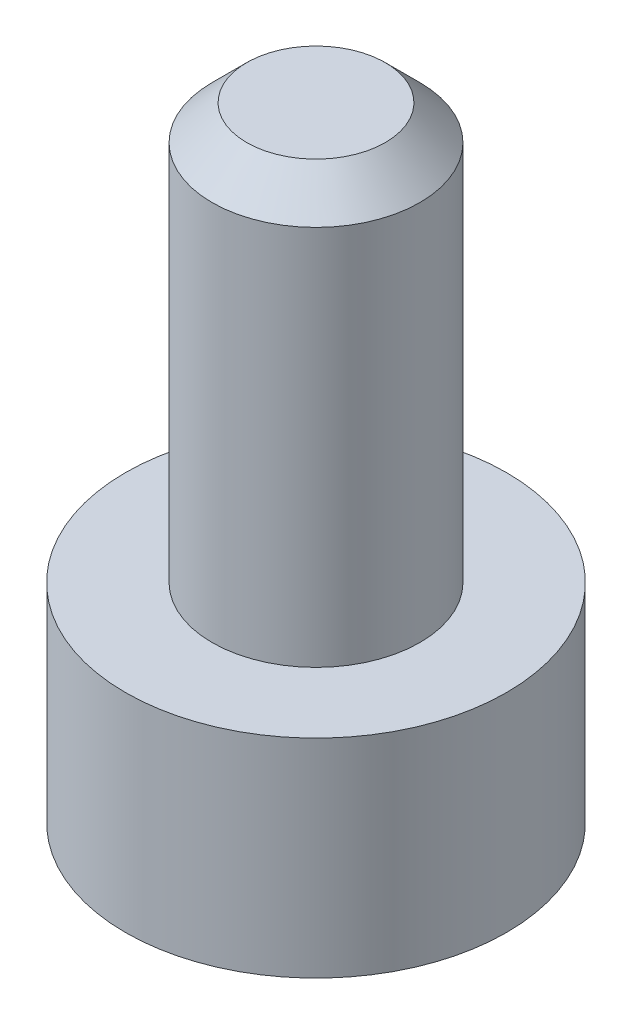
ISO-10303-21;
HEADER;
FILE_DESCRIPTION(('STEP AP214'),'2;1');
FILE_NAME('part.step','',(''),(''),'','','');
FILE_SCHEMA(('AUTOMOTIVE_DESIGN { 1 0 10303 214 1 1 1 1 }'));
ENDSEC;
DATA;
#1=APPLICATION_CONTEXT('core data for automotive mechanical design processes');
#2=APPLICATION_PROTOCOL_DEFINITION('international standard','automotive_design',2000,#1);
#3=PRODUCT_CONTEXT('',#1,'mechanical');
#4=PRODUCT('Part','Part','',(#3));
#5=PRODUCT_RELATED_PRODUCT_CATEGORY('part','',(#4));
#6=PRODUCT_DEFINITION_FORMATION('','',#4);
#7=PRODUCT_DEFINITION_CONTEXT('part definition',#1,'design');
#8=PRODUCT_DEFINITION('design','',#6,#7);
#9=PRODUCT_DEFINITION_SHAPE('','',#8);
#10=(LENGTH_UNIT() NAMED_UNIT(*) SI_UNIT(.MILLI.,.METRE.));
#11=(NAMED_UNIT(*) PLANE_ANGLE_UNIT() SI_UNIT($,.RADIAN.));
#12=(NAMED_UNIT(*) SI_UNIT($,.STERADIAN.) SOLID_ANGLE_UNIT());
#13=UNCERTAINTY_MEASURE_WITH_UNIT(LENGTH_MEASURE(1.E-05),#10,'distance_accuracy_value','');
#14=(GEOMETRIC_REPRESENTATION_CONTEXT(3) GLOBAL_UNCERTAINTY_ASSIGNED_CONTEXT((#13)) GLOBAL_UNIT_ASSIGNED_CONTEXT((#10,
#11,#12)) REPRESENTATION_CONTEXT('',''));
#15=CARTESIAN_POINT('',(0.,0.,0.));
#16=DIRECTION('',(0.,0.,1.));
#17=DIRECTION('',(1.,0.,0.));
#18=AXIS2_PLACEMENT_3D('',#15,#16,#17);
#19=CARTESIAN_POINT('',(-14.,2.00000000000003,1.44337567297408));
#20=DIRECTION('',(-0.500000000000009,0.,-0.866025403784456));
#21=DIRECTION('',(0.866025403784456,0.,-0.500000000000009));
#22=AXIS2_PLACEMENT_3D('',#19,#20,#21);
#23=PLANE('',#22);
#24=DIRECTION('',(0.,-1.,0.));
#25=VECTOR('',#24,1.);
#26=CARTESIAN_POINT('',(-12.75,2.,0.721687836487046));
#27=LINE('',#26,#25);
#28=CARTESIAN_POINT('',(-12.75,2.,0.721687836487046));
#29=VERTEX_POINT('',#28);
#30=CARTESIAN_POINT('',(-12.75,0.500000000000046,0.721687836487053));
#31=VERTEX_POINT('',#30);
#32=EDGE_CURVE('E66',#29,#31,#27,.T.);
#33=ORIENTED_EDGE('',*,*,#32,.T.);
#34=DIRECTION('',(0.866025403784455,0.,-0.500000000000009));
#35=VECTOR('',#34,1.);
#36=CARTESIAN_POINT('',(-14.,0.500000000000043,1.4433756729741));
#37=LINE('',#36,#35);
#38=CARTESIAN_POINT('',(-14.,0.500000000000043,1.4433756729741));
#39=VERTEX_POINT('',#38);
#40=EDGE_CURVE('E32',#39,#31,#37,.T.);
#41=ORIENTED_EDGE('',*,*,#40,.F.);
#42=DIRECTION('',(0.,-1.,0.));
#43=VECTOR('',#42,1.);
#44=CARTESIAN_POINT('',(-14.,2.00000000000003,1.44337567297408));
#45=LINE('',#44,#43);
#46=CARTESIAN_POINT('',(-14.,2.00000000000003,1.44337567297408));
#47=VERTEX_POINT('',#46);
#48=EDGE_CURVE('E36',#47,#39,#45,.T.);
#49=ORIENTED_EDGE('',*,*,#48,.F.);
#50=DIRECTION('',(0.866025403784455,0.,-0.500000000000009));
#51=VECTOR('',#50,1.);
#52=CARTESIAN_POINT('',(-14.,2.00000000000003,1.44337567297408));
#53=LINE('',#52,#51);
#54=EDGE_CURVE('E68',#47,#29,#53,.T.);
#55=ORIENTED_EDGE('',*,*,#54,.T.);
#56=EDGE_LOOP('',(#33,#41,#49,#55));
#57=FACE_BOUND('',#56,.T.);
#58=ADVANCED_FACE('F17',(#57),#23,.T.);
#59=CARTESIAN_POINT('',(-12.75,2.00000000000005,-0.721687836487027));
#60=DIRECTION('',(1.00000000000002,0.,0.));
#61=DIRECTION('',(0.,0.,1.00000000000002));
#62=AXIS2_PLACEMENT_3D('',#59,#60,#61);
#63=PLANE('',#62);
#64=DIRECTION('',(0.,-1.,0.));
#65=VECTOR('',#64,1.);
#66=CARTESIAN_POINT('',(-12.75,2.00000000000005,-0.721687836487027));
#67=LINE('',#66,#65);
#68=CARTESIAN_POINT('',(-12.75,2.00000000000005,-0.721687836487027));
#69=VERTEX_POINT('',#68);
#70=CARTESIAN_POINT('',(-12.75,0.50000000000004,-0.721687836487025));
#71=VERTEX_POINT('',#70);
#72=EDGE_CURVE('E73',#69,#71,#67,.T.);
#73=ORIENTED_EDGE('',*,*,#72,.T.);
#74=DIRECTION('',(0.,0.,1.00000000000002));
#75=VECTOR('',#74,1.);
#76=CARTESIAN_POINT('',(-12.75,0.50000000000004,-0.721687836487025));
#77=LINE('',#76,#75);
#78=EDGE_CURVE('E76',#71,#31,#77,.T.);
#79=ORIENTED_EDGE('',*,*,#78,.T.);
#80=ORIENTED_EDGE('',*,*,#32,.F.);
#81=DIRECTION('',(0.,0.,1.00000000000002));
#82=VECTOR('',#81,1.);
#83=CARTESIAN_POINT('',(-12.75,2.00000000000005,-0.721687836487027));
#84=LINE('',#83,#82);
#85=EDGE_CURVE('E103',#69,#29,#84,.T.);
#86=ORIENTED_EDGE('',*,*,#85,.F.);
#87=EDGE_LOOP('',(#73,#79,#80,#86));
#88=FACE_BOUND('',#87,.T.);
#89=ADVANCED_FACE('F77',(#88),#63,.F.);
#90=CARTESIAN_POINT('',(-14.,2.00000000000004,-1.44337567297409));
#91=DIRECTION('',(0.500000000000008,0.,-0.866025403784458));
#92=DIRECTION('',(0.866025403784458,0.,0.500000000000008));
#93=AXIS2_PLACEMENT_3D('',#90,#91,#92);
#94=PLANE('',#93);
#95=DIRECTION('',(0.,-1.,0.));
#96=VECTOR('',#95,1.);
#97=CARTESIAN_POINT('',(-14.,2.00000000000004,-1.44337567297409));
#98=LINE('',#97,#96);
#99=CARTESIAN_POINT('',(-14.,2.00000000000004,-1.44337567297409));
#100=VERTEX_POINT('',#99);
#101=CARTESIAN_POINT('',(-14.,0.50000000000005,-1.44337567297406));
#102=VERTEX_POINT('',#101);
#103=EDGE_CURVE('E112',#100,#102,#98,.T.);
#104=ORIENTED_EDGE('',*,*,#103,.T.);
#105=DIRECTION('',(0.866025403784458,0.,0.500000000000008));
#106=VECTOR('',#105,1.);
#107=CARTESIAN_POINT('',(-14.,0.50000000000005,-1.44337567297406));
#108=LINE('',#107,#106);
#109=EDGE_CURVE('E81',#102,#71,#108,.T.);
#110=ORIENTED_EDGE('',*,*,#109,.T.);
#111=ORIENTED_EDGE('',*,*,#72,.F.);
#112=DIRECTION('',(0.866025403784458,0.,0.500000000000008));
#113=VECTOR('',#112,1.);
#114=CARTESIAN_POINT('',(-14.,2.00000000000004,-1.44337567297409));
#115=LINE('',#114,#113);
#116=EDGE_CURVE('E100',#100,#69,#115,.T.);
#117=ORIENTED_EDGE('',*,*,#116,.F.);
#118=EDGE_LOOP('',(#104,#110,#111,#117));
#119=FACE_BOUND('',#118,.T.);
#120=ADVANCED_FACE('F145',(#119),#94,.F.);
#121=CARTESIAN_POINT('',(-14.,2.00000000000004,-1.44337567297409));
#122=DIRECTION('',(0.500000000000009,0.,0.866025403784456));
#123=DIRECTION('',(-0.866025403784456,0.,0.500000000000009));
#124=AXIS2_PLACEMENT_3D('',#121,#122,#123);
#125=PLANE('',#124);
#126=DIRECTION('',(0.,-1.,0.));
#127=VECTOR('',#126,1.);
#128=CARTESIAN_POINT('',(-15.25,2.00000000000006,-0.72168783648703));
#129=LINE('',#128,#127);
#130=CARTESIAN_POINT('',(-15.25,2.00000000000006,-0.72168783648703));
#131=VERTEX_POINT('',#130);
#132=CARTESIAN_POINT('',(-15.25,0.500000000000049,-0.721687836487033));
#133=VERTEX_POINT('',#132);
#134=EDGE_CURVE('E110',#131,#133,#129,.T.);
#135=ORIENTED_EDGE('',*,*,#134,.T.);
#136=DIRECTION('',(-0.866025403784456,0.,0.500000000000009));
#137=VECTOR('',#136,1.);
#138=CARTESIAN_POINT('',(-14.,0.50000000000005,-1.44337567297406));
#139=LINE('',#138,#137);
#140=EDGE_CURVE('E193',#102,#133,#139,.T.);
#141=ORIENTED_EDGE('',*,*,#140,.F.);
#142=ORIENTED_EDGE('',*,*,#103,.F.);
#143=DIRECTION('',(-0.866025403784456,0.,0.500000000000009));
#144=VECTOR('',#143,1.);
#145=CARTESIAN_POINT('',(-14.,2.00000000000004,-1.44337567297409));
#146=LINE('',#145,#144);
#147=EDGE_CURVE('E97',#100,#131,#146,.T.);
#148=ORIENTED_EDGE('',*,*,#147,.T.);
#149=EDGE_LOOP('',(#135,#141,#142,#148));
#150=FACE_BOUND('',#149,.T.);
#151=ADVANCED_FACE('F157',(#150),#125,.T.);
#152=CARTESIAN_POINT('',(-15.25,2.,0.721687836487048));
#153=DIRECTION('',(-1.00000000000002,0.,0.));
#154=DIRECTION('',(0.,0.,-1.00000000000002));
#155=AXIS2_PLACEMENT_3D('',#152,#153,#154);
#156=PLANE('',#155);
#157=DIRECTION('',(0.,-1.,0.));
#158=VECTOR('',#157,1.);
#159=CARTESIAN_POINT('',(-15.25,2.,0.721687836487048));
#160=LINE('',#159,#158);
#161=CARTESIAN_POINT('',(-15.25,2.,0.721687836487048));
#162=VERTEX_POINT('',#161);
#163=CARTESIAN_POINT('',(-15.25,0.500000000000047,0.721687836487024));
#164=VERTEX_POINT('',#163);
#165=EDGE_CURVE('E108',#162,#164,#160,.T.);
#166=ORIENTED_EDGE('',*,*,#165,.T.);
#167=DIRECTION('',(0.,0.,-1.00000000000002));
#168=VECTOR('',#167,1.);
#169=CARTESIAN_POINT('',(-15.25,0.500000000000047,0.721687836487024));
#170=LINE('',#169,#168);
#171=EDGE_CURVE('E194',#164,#133,#170,.T.);
#172=ORIENTED_EDGE('',*,*,#171,.T.);
#173=ORIENTED_EDGE('',*,*,#134,.F.);
#174=DIRECTION('',(0.,0.,-1.00000000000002));
#175=VECTOR('',#174,1.);
#176=CARTESIAN_POINT('',(-15.25,2.,0.721687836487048));
#177=LINE('',#176,#175);
#178=EDGE_CURVE('E94',#162,#131,#177,.T.);
#179=ORIENTED_EDGE('',*,*,#178,.F.);
#180=EDGE_LOOP('',(#166,#172,#173,#179));
#181=FACE_BOUND('',#180,.T.);
#182=ADVANCED_FACE('F153',(#181),#156,.F.);
#183=CARTESIAN_POINT('',(-14.,2.00000000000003,1.44337567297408));
#184=DIRECTION('',(-0.500000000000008,0.,0.866025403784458));
#185=DIRECTION('',(-0.866025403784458,0.,-0.500000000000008));
#186=AXIS2_PLACEMENT_3D('',#183,#184,#185);
#187=PLANE('',#186);
#188=DIRECTION('',(-0.866025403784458,0.,-0.500000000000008));
#189=VECTOR('',#188,1.);
#190=CARTESIAN_POINT('',(-14.,2.00000000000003,1.44337567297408));
#191=LINE('',#190,#189);
#192=EDGE_CURVE('E91',#47,#162,#191,.T.);
#193=ORIENTED_EDGE('',*,*,#192,.F.);
#194=ORIENTED_EDGE('',*,*,#48,.T.);
#195=DIRECTION('',(-0.866025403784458,0.,-0.500000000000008));
#196=VECTOR('',#195,1.);
#197=CARTESIAN_POINT('',(-14.,0.500000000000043,1.4433756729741));
#198=LINE('',#197,#196);
#199=EDGE_CURVE('E87',#39,#164,#198,.T.);
#200=ORIENTED_EDGE('',*,*,#199,.T.);
#201=ORIENTED_EDGE('',*,*,#165,.F.);
#202=EDGE_LOOP('',(#193,#194,#200,#201));
#203=FACE_BOUND('',#202,.T.);
#204=ADVANCED_FACE('F150',(#203),#187,.F.);
#205=CARTESIAN_POINT('',(-12.75,2.,0.721687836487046));
#206=DIRECTION('',(0.,-1.,0.));
#207=DIRECTION('',(1.00000000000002,0.,0.));
#208=AXIS2_PLACEMENT_3D('',#205,#206,#207);
#209=PLANE('',#208);
#210=ORIENTED_EDGE('',*,*,#54,.F.);
#211=ORIENTED_EDGE('',*,*,#192,.T.);
#212=ORIENTED_EDGE('',*,*,#178,.T.);
#213=ORIENTED_EDGE('',*,*,#147,.F.);
#214=ORIENTED_EDGE('',*,*,#116,.T.);
#215=ORIENTED_EDGE('',*,*,#85,.T.);
#216=EDGE_LOOP('',(#210,#211,#212,#213,#214,#215));
#217=FACE_BOUND('',#216,.T.);
#218=ADVANCED_FACE('F149',(#217),#209,.T.);
#219=CARTESIAN_POINT('',(-14.,0.500000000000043,0.));
#220=DIRECTION('',(0.,-1.,0.));
#221=DIRECTION('',(1.00000000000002,0.,0.));
#222=AXIS2_PLACEMENT_3D('',#219,#220,#221);
#223=PLANE('',#222);
#224=CARTESIAN_POINT('',(-14.,0.500000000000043,0.));
#225=DIRECTION('',(0.,-1.,0.));
#226=DIRECTION('',(1.00000000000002,0.,0.));
#227=AXIS2_PLACEMENT_3D('',#224,#225,#226);
#228=CIRCLE('',#227,2.75);
#229=CARTESIAN_POINT('',(-11.2499999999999,0.500000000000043,0.));
#230=VERTEX_POINT('',#229);
#231=EDGE_CURVE('E120',#230,#230,#228,.T.);
#232=ORIENTED_EDGE('',*,*,#231,.T.);
#233=EDGE_LOOP('',(#232));
#234=FACE_BOUND('',#233,.T.);
#235=ORIENTED_EDGE('',*,*,#199,.F.);
#236=ORIENTED_EDGE('',*,*,#40,.T.);
#237=ORIENTED_EDGE('',*,*,#78,.F.);
#238=ORIENTED_EDGE('',*,*,#109,.F.);
#239=ORIENTED_EDGE('',*,*,#140,.T.);
#240=ORIENTED_EDGE('',*,*,#171,.F.);
#241=EDGE_LOOP('',(#235,#236,#237,#238,#239,#240));
#242=FACE_BOUND('',#241,.T.);
#243=ADVANCED_FACE('F84',(#234,#242),#223,.T.);
#244=CARTESIAN_POINT('',(-14.,-10.4999999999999,0.));
#245=DIRECTION('',(0.,-1.,0.));
#246=DIRECTION('',(1.00000000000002,0.,0.));
#247=AXIS2_PLACEMENT_3D('',#244,#245,#246);
#248=CYLINDRICAL_SURFACE('',#247,2.75);
#249=CARTESIAN_POINT('',(-14.,3.5,0.));
#250=DIRECTION('',(0.,-1.,0.));
#251=DIRECTION('',(1.00000000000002,0.,0.));
#252=AXIS2_PLACEMENT_3D('',#249,#250,#251);
#253=CIRCLE('',#252,2.75);
#254=CARTESIAN_POINT('',(-11.2499999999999,3.5,0.));
#255=VERTEX_POINT('',#254);
#256=EDGE_CURVE('E117',#255,#255,#253,.T.);
#257=ORIENTED_EDGE('',*,*,#256,.T.);
#258=EDGE_LOOP('',(#257));
#259=FACE_BOUND('',#258,.T.);
#260=ORIENTED_EDGE('',*,*,#231,.F.);
#261=EDGE_LOOP('',(#260));
#262=FACE_BOUND('',#261,.T.);
#263=ADVANCED_FACE('F170',(#259,#262),#248,.T.);
#264=CARTESIAN_POINT('',(-11.25,3.5,0.));
#265=DIRECTION('',(0.,1.,0.));
#266=DIRECTION('',(-1.00000000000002,0.,0.));
#267=AXIS2_PLACEMENT_3D('',#264,#265,#266);
#268=PLANE('',#267);
#269=CARTESIAN_POINT('',(-14.,3.5,0.));
#270=DIRECTION('',(0.,-1.,0.));
#271=DIRECTION('',(1.00000000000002,0.,0.));
#272=AXIS2_PLACEMENT_3D('',#269,#270,#271);
#273=CIRCLE('',#272,1.5);
#274=CARTESIAN_POINT('',(-12.5,3.5,0.));
#275=VERTEX_POINT('',#274);
#276=EDGE_CURVE('E72',#275,#275,#273,.T.);
#277=ORIENTED_EDGE('',*,*,#276,.T.);
#278=EDGE_LOOP('',(#277));
#279=FACE_BOUND('',#278,.T.);
#280=ORIENTED_EDGE('',*,*,#256,.F.);
#281=EDGE_LOOP('',(#280));
#282=FACE_BOUND('',#281,.T.);
#283=ADVANCED_FACE('F167',(#279,#282),#268,.T.);
#284=CARTESIAN_POINT('',(-14.,-10.4999999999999,0.));
#285=DIRECTION('',(0.,-1.,0.));
#286=DIRECTION('',(1.00000000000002,0.,0.));
#287=AXIS2_PLACEMENT_3D('',#284,#285,#286);
#288=CYLINDRICAL_SURFACE('',#287,1.5);
#289=CARTESIAN_POINT('',(-14.,8.99999999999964,0.));
#290=DIRECTION('',(0.,1.,0.));
#291=DIRECTION('',(-1.00000000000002,0.,0.));
#292=AXIS2_PLACEMENT_3D('',#289,#290,#291);
#293=CIRCLE('',#292,1.5);
#294=CARTESIAN_POINT('',(-15.5,8.99999999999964,0.));
#295=VERTEX_POINT('',#294);
#296=EDGE_CURVE('E25',#295,#295,#293,.F.);
#297=ORIENTED_EDGE('',*,*,#296,.T.);
#298=EDGE_LOOP('',(#297));
#299=FACE_BOUND('',#298,.T.);
#300=ORIENTED_EDGE('',*,*,#276,.F.);
#301=EDGE_LOOP('',(#300));
#302=FACE_BOUND('',#301,.T.);
#303=ADVANCED_FACE('F125',(#299,#302),#288,.T.);
#304=CARTESIAN_POINT('',(-12.5,9.5,0.));
#305=DIRECTION('',(0.,1.,0.));
#306=DIRECTION('',(-1.00000000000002,0.,0.));
#307=AXIS2_PLACEMENT_3D('',#304,#305,#306);
#308=PLANE('',#307);
#309=CARTESIAN_POINT('',(-14.,9.5,0.));
#310=DIRECTION('',(0.,1.,0.));
#311=DIRECTION('',(0.,0.,1.00000000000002));
#312=AXIS2_PLACEMENT_3D('',#309,#310,#311);
#313=CIRCLE('',#312,0.999999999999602);
#314=CARTESIAN_POINT('',(-14.,9.5,0.999999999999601));
#315=VERTEX_POINT('',#314);
#316=EDGE_CURVE('E11',#315,#315,#313,.T.);
#317=ORIENTED_EDGE('',*,*,#316,.T.);
#318=EDGE_LOOP('',(#317));
#319=FACE_BOUND('',#318,.T.);
#320=ADVANCED_FACE('F129',(#319),#308,.T.);
#321=CARTESIAN_POINT('',(-14.,8.99999999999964,0.));
#322=DIRECTION('',(0.,-1.,0.));
#323=DIRECTION('',(1.00000000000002,0.,0.));
#324=AXIS2_PLACEMENT_3D('',#321,#322,#323);
#325=CONICAL_SURFACE('',#324,1.5,0.785398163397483);
#326=ORIENTED_EDGE('',*,*,#316,.F.);
#327=EDGE_LOOP('',(#326));
#328=FACE_BOUND('',#327,.T.);
#329=ORIENTED_EDGE('',*,*,#296,.F.);
#330=EDGE_LOOP('',(#329));
#331=FACE_BOUND('',#330,.T.);
#332=ADVANCED_FACE('F19',(#328,#331),#325,.T.);
#333=CLOSED_SHELL('',(#58,#89,#120,#151,#182,#204,#218,#243,#263,#283,#303,#320,#332));
#334=MANIFOLD_SOLID_BREP('B1',#333);
#335=ADVANCED_BREP_SHAPE_REPRESENTATION('',(#18,#334),#14);
#336=SHAPE_DEFINITION_REPRESENTATION(#9,#335);
ENDSEC;
END-ISO-10303-21;
